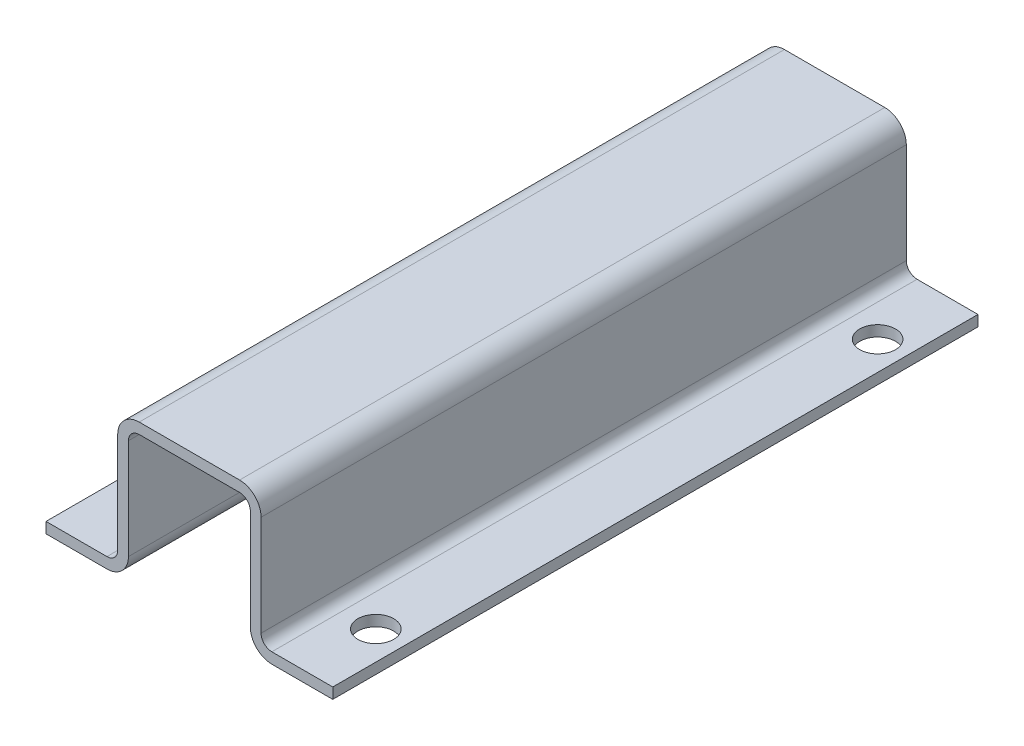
ISO-10303-21;
HEADER;
FILE_DESCRIPTION(('STEP AP214'),'2;1');
FILE_NAME('part.step','',(''),(''),'','','');
FILE_SCHEMA(('AUTOMOTIVE_DESIGN { 1 0 10303 214 1 1 1 1 }'));
ENDSEC;
DATA;
#1=APPLICATION_CONTEXT('core data for automotive mechanical design processes');
#2=APPLICATION_PROTOCOL_DEFINITION('international standard','automotive_design',2000,#1);
#3=PRODUCT_CONTEXT('',#1,'mechanical');
#4=PRODUCT('Part','Part','',(#3));
#5=PRODUCT_RELATED_PRODUCT_CATEGORY('part','',(#4));
#6=PRODUCT_DEFINITION_FORMATION('','',#4);
#7=PRODUCT_DEFINITION_CONTEXT('part definition',#1,'design');
#8=PRODUCT_DEFINITION('design','',#6,#7);
#9=PRODUCT_DEFINITION_SHAPE('','',#8);
#10=(LENGTH_UNIT() NAMED_UNIT(*) SI_UNIT(.MILLI.,.METRE.));
#11=(NAMED_UNIT(*) PLANE_ANGLE_UNIT() SI_UNIT($,.RADIAN.));
#12=(NAMED_UNIT(*) SI_UNIT($,.STERADIAN.) SOLID_ANGLE_UNIT());
#13=UNCERTAINTY_MEASURE_WITH_UNIT(LENGTH_MEASURE(1.E-05),#10,'distance_accuracy_value','');
#14=(GEOMETRIC_REPRESENTATION_CONTEXT(3) GLOBAL_UNCERTAINTY_ASSIGNED_CONTEXT((#13)) GLOBAL_UNIT_ASSIGNED_CONTEXT((#10,
#11,#12)) REPRESENTATION_CONTEXT('',''));
#15=CARTESIAN_POINT('',(0.,0.,0.));
#16=DIRECTION('',(0.,0.,1.));
#17=DIRECTION('',(1.,0.,0.));
#18=AXIS2_PLACEMENT_3D('',#15,#16,#17);
#19=CARTESIAN_POINT('',(11.5,-1.5,45.));
#20=DIRECTION('',(0.,1.,0.));
#21=DIRECTION('',(-1.,0.,0.));
#22=AXIS2_PLACEMENT_3D('',#19,#20,#21);
#23=PLANE('',#22);
#24=CARTESIAN_POINT('',(16.,-1.50000000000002,-35.));
#25=DIRECTION('',(0.,1.,0.));
#26=DIRECTION('',(-1.,0.,0.));
#27=AXIS2_PLACEMENT_3D('',#24,#25,#26);
#28=CIRCLE('',#27,2.5);
#29=CARTESIAN_POINT('',(13.5,-1.50000000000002,-35.));
#30=VERTEX_POINT('',#29);
#31=EDGE_CURVE('E366',#30,#30,#28,.T.);
#32=ORIENTED_EDGE('',*,*,#31,.T.);
#33=EDGE_LOOP('',(#32));
#34=FACE_BOUND('',#33,.T.);
#35=CARTESIAN_POINT('',(16.,-1.50000000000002,35.));
#36=DIRECTION('',(0.,1.,0.));
#37=DIRECTION('',(-1.,0.,0.));
#38=AXIS2_PLACEMENT_3D('',#35,#36,#37);
#39=CIRCLE('',#38,2.5);
#40=CARTESIAN_POINT('',(13.5,-1.50000000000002,35.));
#41=VERTEX_POINT('',#40);
#42=EDGE_CURVE('E184',#41,#41,#39,.T.);
#43=ORIENTED_EDGE('',*,*,#42,.T.);
#44=EDGE_LOOP('',(#43));
#45=FACE_BOUND('',#44,.T.);
#46=DIRECTION('',(1.,0.,0.));
#47=VECTOR('',#46,1.);
#48=CARTESIAN_POINT('',(11.5,-1.5,-45.));
#49=LINE('',#48,#47);
#50=CARTESIAN_POINT('',(11.5,-1.5,-45.));
#51=VERTEX_POINT('',#50);
#52=CARTESIAN_POINT('',(20.,-1.5,-45.));
#53=VERTEX_POINT('',#52);
#54=EDGE_CURVE('E180',#51,#53,#49,.T.);
#55=ORIENTED_EDGE('',*,*,#54,.T.);
#56=DIRECTION('',(0.,0.,-1.));
#57=VECTOR('',#56,1.);
#58=CARTESIAN_POINT('',(20.,-1.5,45.));
#59=LINE('',#58,#57);
#60=CARTESIAN_POINT('',(20.,-1.5,45.));
#61=VERTEX_POINT('',#60);
#62=EDGE_CURVE('E11',#61,#53,#59,.T.);
#63=ORIENTED_EDGE('',*,*,#62,.F.);
#64=DIRECTION('',(1.,0.,0.));
#65=VECTOR('',#64,1.);
#66=CARTESIAN_POINT('',(11.5,-1.5,45.));
#67=LINE('',#66,#65);
#68=CARTESIAN_POINT('',(11.5,-1.5,45.));
#69=VERTEX_POINT('',#68);
#70=EDGE_CURVE('E236',#69,#61,#67,.T.);
#71=ORIENTED_EDGE('',*,*,#70,.F.);
#72=DIRECTION('',(0.,0.,-1.));
#73=VECTOR('',#72,1.);
#74=CARTESIAN_POINT('',(11.5,-1.5,45.));
#75=LINE('',#74,#73);
#76=EDGE_CURVE('E181',#69,#51,#75,.T.);
#77=ORIENTED_EDGE('',*,*,#76,.T.);
#78=EDGE_LOOP('',(#55,#63,#71,#77));
#79=FACE_BOUND('',#78,.T.);
#80=ADVANCED_FACE('F32',(#34,#45,#79),#23,.F.);
#81=CARTESIAN_POINT('',(20.,0.,45.));
#82=DIRECTION('',(1.,0.,0.));
#83=DIRECTION('',(0.,0.,-1.));
#84=AXIS2_PLACEMENT_3D('',#81,#82,#83);
#85=PLANE('',#84);
#86=DIRECTION('',(0.,-1.,0.));
#87=VECTOR('',#86,1.);
#88=CARTESIAN_POINT('',(20.,0.,-45.));
#89=LINE('',#88,#87);
#90=CARTESIAN_POINT('',(20.,0.,-45.));
#91=VERTEX_POINT('',#90);
#92=EDGE_CURVE('E172',#91,#53,#89,.T.);
#93=ORIENTED_EDGE('',*,*,#92,.F.);
#94=DIRECTION('',(0.,0.,-1.));
#95=VECTOR('',#94,1.);
#96=CARTESIAN_POINT('',(20.,0.,45.));
#97=LINE('',#96,#95);
#98=CARTESIAN_POINT('',(20.,0.,45.));
#99=VERTEX_POINT('',#98);
#100=EDGE_CURVE('E40',#99,#91,#97,.T.);
#101=ORIENTED_EDGE('',*,*,#100,.F.);
#102=DIRECTION('',(0.,-1.,0.));
#103=VECTOR('',#102,1.);
#104=CARTESIAN_POINT('',(20.,0.,45.));
#105=LINE('',#104,#103);
#106=EDGE_CURVE('E175',#99,#61,#105,.T.);
#107=ORIENTED_EDGE('',*,*,#106,.T.);
#108=ORIENTED_EDGE('',*,*,#62,.T.);
#109=EDGE_LOOP('',(#93,#101,#107,#108));
#110=FACE_BOUND('',#109,.T.);
#111=ADVANCED_FACE('F170',(#110),#85,.T.);
#112=CARTESIAN_POINT('',(11.5,0.,45.));
#113=DIRECTION('',(0.,1.,0.));
#114=DIRECTION('',(-1.,0.,0.));
#115=AXIS2_PLACEMENT_3D('',#112,#113,#114);
#116=PLANE('',#115);
#117=CARTESIAN_POINT('',(16.,0.,-35.));
#118=DIRECTION('',(0.,1.,0.));
#119=DIRECTION('',(-1.,0.,0.));
#120=AXIS2_PLACEMENT_3D('',#117,#118,#119);
#121=CIRCLE('',#120,2.5);
#122=CARTESIAN_POINT('',(13.5,0.,-35.));
#123=VERTEX_POINT('',#122);
#124=EDGE_CURVE('E368',#123,#123,#121,.T.);
#125=ORIENTED_EDGE('',*,*,#124,.F.);
#126=EDGE_LOOP('',(#125));
#127=FACE_BOUND('',#126,.T.);
#128=CARTESIAN_POINT('',(16.,0.,35.));
#129=DIRECTION('',(0.,1.,0.));
#130=DIRECTION('',(-1.,0.,0.));
#131=AXIS2_PLACEMENT_3D('',#128,#129,#130);
#132=CIRCLE('',#131,2.5);
#133=CARTESIAN_POINT('',(13.5,0.,35.));
#134=VERTEX_POINT('',#133);
#135=EDGE_CURVE('E327',#134,#134,#132,.T.);
#136=ORIENTED_EDGE('',*,*,#135,.F.);
#137=EDGE_LOOP('',(#136));
#138=FACE_BOUND('',#137,.T.);
#139=DIRECTION('',(1.,0.,0.));
#140=VECTOR('',#139,1.);
#141=CARTESIAN_POINT('',(11.5,0.,-45.));
#142=LINE('',#141,#140);
#143=CARTESIAN_POINT('',(11.5,0.,-45.));
#144=VERTEX_POINT('',#143);
#145=EDGE_CURVE('E189',#144,#91,#142,.T.);
#146=ORIENTED_EDGE('',*,*,#145,.F.);
#147=DIRECTION('',(0.,0.,-1.));
#148=VECTOR('',#147,1.);
#149=CARTESIAN_POINT('',(11.5,0.,45.));
#150=LINE('',#149,#148);
#151=CARTESIAN_POINT('',(11.5,0.,45.));
#152=VERTEX_POINT('',#151);
#153=EDGE_CURVE('E323',#152,#144,#150,.T.);
#154=ORIENTED_EDGE('',*,*,#153,.F.);
#155=DIRECTION('',(1.,0.,0.));
#156=VECTOR('',#155,1.);
#157=CARTESIAN_POINT('',(11.5,0.,45.));
#158=LINE('',#157,#156);
#159=EDGE_CURVE('E239',#152,#99,#158,.T.);
#160=ORIENTED_EDGE('',*,*,#159,.T.);
#161=ORIENTED_EDGE('',*,*,#100,.T.);
#162=EDGE_LOOP('',(#146,#154,#160,#161));
#163=FACE_BOUND('',#162,.T.);
#164=ADVANCED_FACE('F363',(#127,#138,#163),#116,.T.);
#165=CARTESIAN_POINT('',(11.5,1.5,45.));
#166=DIRECTION('',(0.,0.,-1.));
#167=DIRECTION('',(-1.,0.,0.));
#168=AXIS2_PLACEMENT_3D('',#165,#166,#167);
#169=CYLINDRICAL_SURFACE('',#168,1.5);
#170=CARTESIAN_POINT('',(11.5,1.5,-45.));
#171=DIRECTION('',(0.,0.,1.));
#172=DIRECTION('',(1.,0.,0.));
#173=AXIS2_PLACEMENT_3D('',#170,#171,#172);
#174=CIRCLE('',#173,1.5);
#175=CARTESIAN_POINT('',(10.,1.5,-45.));
#176=VERTEX_POINT('',#175);
#177=EDGE_CURVE('E191',#176,#144,#174,.T.);
#178=ORIENTED_EDGE('',*,*,#177,.F.);
#179=DIRECTION('',(0.,0.,-1.));
#180=VECTOR('',#179,1.);
#181=CARTESIAN_POINT('',(10.,1.5,45.));
#182=LINE('',#181,#180);
#183=CARTESIAN_POINT('',(10.,1.5,45.));
#184=VERTEX_POINT('',#183);
#185=EDGE_CURVE('E321',#184,#176,#182,.T.);
#186=ORIENTED_EDGE('',*,*,#185,.F.);
#187=CARTESIAN_POINT('',(11.5,1.5,45.));
#188=DIRECTION('',(0.,0.,1.));
#189=DIRECTION('',(1.,0.,0.));
#190=AXIS2_PLACEMENT_3D('',#187,#188,#189);
#191=CIRCLE('',#190,1.5);
#192=EDGE_CURVE('E242',#184,#152,#191,.T.);
#193=ORIENTED_EDGE('',*,*,#192,.T.);
#194=ORIENTED_EDGE('',*,*,#153,.T.);
#195=EDGE_LOOP('',(#178,#186,#193,#194));
#196=FACE_BOUND('',#195,.T.);
#197=ADVANCED_FACE('F378',(#196),#169,.F.);
#198=CARTESIAN_POINT('',(10.,15.5,45.));
#199=DIRECTION('',(1.,0.,0.));
#200=DIRECTION('',(0.,1.,0.));
#201=AXIS2_PLACEMENT_3D('',#198,#199,#200);
#202=PLANE('',#201);
#203=DIRECTION('',(0.,-1.,0.));
#204=VECTOR('',#203,1.);
#205=CARTESIAN_POINT('',(10.,15.5,-45.));
#206=LINE('',#205,#204);
#207=CARTESIAN_POINT('',(10.,15.5,-45.));
#208=VERTEX_POINT('',#207);
#209=EDGE_CURVE('E196',#208,#176,#206,.T.);
#210=ORIENTED_EDGE('',*,*,#209,.F.);
#211=DIRECTION('',(0.,0.,-1.));
#212=VECTOR('',#211,1.);
#213=CARTESIAN_POINT('',(10.,15.5,45.));
#214=LINE('',#213,#212);
#215=CARTESIAN_POINT('',(10.,15.5,45.));
#216=VERTEX_POINT('',#215);
#217=EDGE_CURVE('E319',#216,#208,#214,.T.);
#218=ORIENTED_EDGE('',*,*,#217,.F.);
#219=DIRECTION('',(0.,-1.,0.));
#220=VECTOR('',#219,1.);
#221=CARTESIAN_POINT('',(10.,15.5,45.));
#222=LINE('',#221,#220);
#223=EDGE_CURVE('E245',#216,#184,#222,.T.);
#224=ORIENTED_EDGE('',*,*,#223,.T.);
#225=ORIENTED_EDGE('',*,*,#185,.T.);
#226=EDGE_LOOP('',(#210,#218,#224,#225));
#227=FACE_BOUND('',#226,.T.);
#228=ADVANCED_FACE('F390',(#227),#202,.T.);
#229=CARTESIAN_POINT('',(7.,15.5,45.));
#230=DIRECTION('',(0.,0.,-1.));
#231=DIRECTION('',(-1.,0.,0.));
#232=AXIS2_PLACEMENT_3D('',#229,#230,#231);
#233=CYLINDRICAL_SURFACE('',#232,3.);
#234=CARTESIAN_POINT('',(7.,15.5,-45.));
#235=DIRECTION('',(0.,0.,-1.));
#236=DIRECTION('',(1.,0.,0.));
#237=AXIS2_PLACEMENT_3D('',#234,#235,#236);
#238=CIRCLE('',#237,3.);
#239=CARTESIAN_POINT('',(7.,18.5,-45.));
#240=VERTEX_POINT('',#239);
#241=EDGE_CURVE('E199',#240,#208,#238,.T.);
#242=ORIENTED_EDGE('',*,*,#241,.F.);
#243=DIRECTION('',(0.,0.,-1.));
#244=VECTOR('',#243,1.);
#245=CARTESIAN_POINT('',(7.,18.5,45.));
#246=LINE('',#245,#244);
#247=CARTESIAN_POINT('',(7.,18.5,45.));
#248=VERTEX_POINT('',#247);
#249=EDGE_CURVE('E317',#248,#240,#246,.T.);
#250=ORIENTED_EDGE('',*,*,#249,.F.);
#251=CARTESIAN_POINT('',(7.,15.5,45.));
#252=DIRECTION('',(0.,0.,-1.));
#253=DIRECTION('',(1.,0.,0.));
#254=AXIS2_PLACEMENT_3D('',#251,#252,#253);
#255=CIRCLE('',#254,3.);
#256=EDGE_CURVE('E248',#248,#216,#255,.T.);
#257=ORIENTED_EDGE('',*,*,#256,.T.);
#258=ORIENTED_EDGE('',*,*,#217,.T.);
#259=EDGE_LOOP('',(#242,#250,#257,#258));
#260=FACE_BOUND('',#259,.T.);
#261=ADVANCED_FACE('F393',(#260),#233,.T.);
#262=CARTESIAN_POINT('',(-7.,18.5,45.));
#263=DIRECTION('',(0.,1.,0.));
#264=DIRECTION('',(0.,0.,1.));
#265=AXIS2_PLACEMENT_3D('',#262,#263,#264);
#266=PLANE('',#265);
#267=DIRECTION('',(1.,0.,0.));
#268=VECTOR('',#267,1.);
#269=CARTESIAN_POINT('',(-7.,18.5,-45.));
#270=LINE('',#269,#268);
#271=CARTESIAN_POINT('',(-7.,18.5,-45.));
#272=VERTEX_POINT('',#271);
#273=EDGE_CURVE('E202',#272,#240,#270,.T.);
#274=ORIENTED_EDGE('',*,*,#273,.F.);
#275=DIRECTION('',(0.,0.,-1.));
#276=VECTOR('',#275,1.);
#277=CARTESIAN_POINT('',(-7.,18.5,45.));
#278=LINE('',#277,#276);
#279=CARTESIAN_POINT('',(-7.,18.5,45.));
#280=VERTEX_POINT('',#279);
#281=EDGE_CURVE('E315',#280,#272,#278,.T.);
#282=ORIENTED_EDGE('',*,*,#281,.F.);
#283=DIRECTION('',(1.,0.,0.));
#284=VECTOR('',#283,1.);
#285=CARTESIAN_POINT('',(-7.,18.5,45.));
#286=LINE('',#285,#284);
#287=EDGE_CURVE('E251',#280,#248,#286,.T.);
#288=ORIENTED_EDGE('',*,*,#287,.T.);
#289=ORIENTED_EDGE('',*,*,#249,.T.);
#290=EDGE_LOOP('',(#274,#282,#288,#289));
#291=FACE_BOUND('',#290,.T.);
#292=ADVANCED_FACE('F398',(#291),#266,.T.);
#293=CARTESIAN_POINT('',(-7.,15.5,45.));
#294=DIRECTION('',(0.,0.,-1.));
#295=DIRECTION('',(-1.,0.,0.));
#296=AXIS2_PLACEMENT_3D('',#293,#294,#295);
#297=CYLINDRICAL_SURFACE('',#296,3.);
#298=CARTESIAN_POINT('',(-7.,15.5,-45.));
#299=DIRECTION('',(0.,0.,-1.));
#300=DIRECTION('',(1.,0.,0.));
#301=AXIS2_PLACEMENT_3D('',#298,#299,#300);
#302=CIRCLE('',#301,3.);
#303=CARTESIAN_POINT('',(-10.,15.5,-45.));
#304=VERTEX_POINT('',#303);
#305=EDGE_CURVE('E205',#304,#272,#302,.T.);
#306=ORIENTED_EDGE('',*,*,#305,.F.);
#307=DIRECTION('',(0.,0.,-1.));
#308=VECTOR('',#307,1.);
#309=CARTESIAN_POINT('',(-10.,15.5,45.));
#310=LINE('',#309,#308);
#311=CARTESIAN_POINT('',(-10.,15.5,45.));
#312=VERTEX_POINT('',#311);
#313=EDGE_CURVE('E313',#312,#304,#310,.T.);
#314=ORIENTED_EDGE('',*,*,#313,.F.);
#315=CARTESIAN_POINT('',(-7.,15.5,45.));
#316=DIRECTION('',(0.,0.,-1.));
#317=DIRECTION('',(1.,0.,0.));
#318=AXIS2_PLACEMENT_3D('',#315,#316,#317);
#319=CIRCLE('',#318,3.);
#320=EDGE_CURVE('E254',#312,#280,#319,.T.);
#321=ORIENTED_EDGE('',*,*,#320,.T.);
#322=ORIENTED_EDGE('',*,*,#281,.T.);
#323=EDGE_LOOP('',(#306,#314,#321,#322));
#324=FACE_BOUND('',#323,.T.);
#325=ADVANCED_FACE('F401',(#324),#297,.T.);
#326=CARTESIAN_POINT('',(-10.,1.5,45.));
#327=DIRECTION('',(-1.,0.,0.));
#328=DIRECTION('',(0.,0.,1.));
#329=AXIS2_PLACEMENT_3D('',#326,#327,#328);
#330=PLANE('',#329);
#331=DIRECTION('',(0.,1.,0.));
#332=VECTOR('',#331,1.);
#333=CARTESIAN_POINT('',(-10.,1.5,-45.));
#334=LINE('',#333,#332);
#335=CARTESIAN_POINT('',(-10.,1.5,-45.));
#336=VERTEX_POINT('',#335);
#337=EDGE_CURVE('E208',#336,#304,#334,.T.);
#338=ORIENTED_EDGE('',*,*,#337,.F.);
#339=DIRECTION('',(0.,0.,-1.));
#340=VECTOR('',#339,1.);
#341=CARTESIAN_POINT('',(-10.,1.5,45.));
#342=LINE('',#341,#340);
#343=CARTESIAN_POINT('',(-10.,1.5,45.));
#344=VERTEX_POINT('',#343);
#345=EDGE_CURVE('E311',#344,#336,#342,.T.);
#346=ORIENTED_EDGE('',*,*,#345,.F.);
#347=DIRECTION('',(0.,1.,0.));
#348=VECTOR('',#347,1.);
#349=CARTESIAN_POINT('',(-10.,1.5,45.));
#350=LINE('',#349,#348);
#351=EDGE_CURVE('E257',#344,#312,#350,.T.);
#352=ORIENTED_EDGE('',*,*,#351,.T.);
#353=ORIENTED_EDGE('',*,*,#313,.T.);
#354=EDGE_LOOP('',(#338,#346,#352,#353));
#355=FACE_BOUND('',#354,.T.);
#356=ADVANCED_FACE('F406',(#355),#330,.T.);
#357=CARTESIAN_POINT('',(-11.5,1.5,45.));
#358=DIRECTION('',(0.,0.,-1.));
#359=DIRECTION('',(-1.,0.,0.));
#360=AXIS2_PLACEMENT_3D('',#357,#358,#359);
#361=CYLINDRICAL_SURFACE('',#360,1.5);
#362=CARTESIAN_POINT('',(-11.5,1.5,-45.));
#363=DIRECTION('',(0.,0.,1.));
#364=DIRECTION('',(-1.,0.,0.));
#365=AXIS2_PLACEMENT_3D('',#362,#363,#364);
#366=CIRCLE('',#365,1.5);
#367=CARTESIAN_POINT('',(-11.5,0.,-45.));
#368=VERTEX_POINT('',#367);
#369=EDGE_CURVE('E211',#368,#336,#366,.T.);
#370=ORIENTED_EDGE('',*,*,#369,.F.);
#371=DIRECTION('',(0.,0.,-1.));
#372=VECTOR('',#371,1.);
#373=CARTESIAN_POINT('',(-11.5,0.,45.));
#374=LINE('',#373,#372);
#375=CARTESIAN_POINT('',(-11.5,0.,45.));
#376=VERTEX_POINT('',#375);
#377=EDGE_CURVE('E309',#376,#368,#374,.T.);
#378=ORIENTED_EDGE('',*,*,#377,.F.);
#379=CARTESIAN_POINT('',(-11.5,1.5,45.));
#380=DIRECTION('',(0.,0.,1.));
#381=DIRECTION('',(-1.,0.,0.));
#382=AXIS2_PLACEMENT_3D('',#379,#380,#381);
#383=CIRCLE('',#382,1.5);
#384=EDGE_CURVE('E260',#376,#344,#383,.T.);
#385=ORIENTED_EDGE('',*,*,#384,.T.);
#386=ORIENTED_EDGE('',*,*,#345,.T.);
#387=EDGE_LOOP('',(#370,#378,#385,#386));
#388=FACE_BOUND('',#387,.T.);
#389=ADVANCED_FACE('F409',(#388),#361,.F.);
#390=CARTESIAN_POINT('',(-20.,0.,45.));
#391=DIRECTION('',(0.,1.,0.));
#392=DIRECTION('',(0.,0.,1.));
#393=AXIS2_PLACEMENT_3D('',#390,#391,#392);
#394=PLANE('',#393);
#395=CARTESIAN_POINT('',(-16.,0.,-35.));
#396=DIRECTION('',(0.,1.,0.));
#397=DIRECTION('',(-1.,0.,0.));
#398=AXIS2_PLACEMENT_3D('',#395,#396,#397);
#399=CIRCLE('',#398,2.5);
#400=CARTESIAN_POINT('',(-18.5,0.,-35.));
#401=VERTEX_POINT('',#400);
#402=EDGE_CURVE('E338',#401,#401,#399,.T.);
#403=ORIENTED_EDGE('',*,*,#402,.F.);
#404=EDGE_LOOP('',(#403));
#405=FACE_BOUND('',#404,.T.);
#406=CARTESIAN_POINT('',(-16.,0.,35.));
#407=DIRECTION('',(0.,1.,0.));
#408=DIRECTION('',(-1.,0.,0.));
#409=AXIS2_PLACEMENT_3D('',#406,#407,#408);
#410=CIRCLE('',#409,2.5);
#411=CARTESIAN_POINT('',(-18.5,0.,35.));
#412=VERTEX_POINT('',#411);
#413=EDGE_CURVE('E328',#412,#412,#410,.T.);
#414=ORIENTED_EDGE('',*,*,#413,.F.);
#415=EDGE_LOOP('',(#414));
#416=FACE_BOUND('',#415,.T.);
#417=DIRECTION('',(1.,0.,0.));
#418=VECTOR('',#417,1.);
#419=CARTESIAN_POINT('',(-20.,0.,-45.));
#420=LINE('',#419,#418);
#421=CARTESIAN_POINT('',(-20.,0.,-45.));
#422=VERTEX_POINT('',#421);
#423=EDGE_CURVE('E214',#422,#368,#420,.T.);
#424=ORIENTED_EDGE('',*,*,#423,.F.);
#425=DIRECTION('',(0.,0.,-1.));
#426=VECTOR('',#425,1.);
#427=CARTESIAN_POINT('',(-20.,0.,45.));
#428=LINE('',#427,#426);
#429=CARTESIAN_POINT('',(-20.,0.,45.));
#430=VERTEX_POINT('',#429);
#431=EDGE_CURVE('E307',#430,#422,#428,.T.);
#432=ORIENTED_EDGE('',*,*,#431,.F.);
#433=DIRECTION('',(1.,0.,0.));
#434=VECTOR('',#433,1.);
#435=CARTESIAN_POINT('',(-20.,0.,45.));
#436=LINE('',#435,#434);
#437=EDGE_CURVE('E263',#430,#376,#436,.T.);
#438=ORIENTED_EDGE('',*,*,#437,.T.);
#439=ORIENTED_EDGE('',*,*,#377,.T.);
#440=EDGE_LOOP('',(#424,#432,#438,#439));
#441=FACE_BOUND('',#440,.T.);
#442=ADVANCED_FACE('F414',(#405,#416,#441),#394,.T.);
#443=CARTESIAN_POINT('',(-20.,-1.5,45.));
#444=DIRECTION('',(-1.,0.,0.));
#445=DIRECTION('',(0.,0.,1.));
#446=AXIS2_PLACEMENT_3D('',#443,#444,#445);
#447=PLANE('',#446);
#448=DIRECTION('',(0.,1.,0.));
#449=VECTOR('',#448,1.);
#450=CARTESIAN_POINT('',(-20.,-1.5,-45.));
#451=LINE('',#450,#449);
#452=CARTESIAN_POINT('',(-20.,-1.5,-45.));
#453=VERTEX_POINT('',#452);
#454=EDGE_CURVE('E217',#453,#422,#451,.T.);
#455=ORIENTED_EDGE('',*,*,#454,.F.);
#456=DIRECTION('',(0.,0.,-1.));
#457=VECTOR('',#456,1.);
#458=CARTESIAN_POINT('',(-20.,-1.5,45.));
#459=LINE('',#458,#457);
#460=CARTESIAN_POINT('',(-20.,-1.5,45.));
#461=VERTEX_POINT('',#460);
#462=EDGE_CURVE('E305',#461,#453,#459,.T.);
#463=ORIENTED_EDGE('',*,*,#462,.F.);
#464=DIRECTION('',(0.,1.,0.));
#465=VECTOR('',#464,1.);
#466=CARTESIAN_POINT('',(-20.,-1.5,45.));
#467=LINE('',#466,#465);
#468=EDGE_CURVE('E266',#461,#430,#467,.T.);
#469=ORIENTED_EDGE('',*,*,#468,.T.);
#470=ORIENTED_EDGE('',*,*,#431,.T.);
#471=EDGE_LOOP('',(#455,#463,#469,#470));
#472=FACE_BOUND('',#471,.T.);
#473=ADVANCED_FACE('F417',(#472),#447,.T.);
#474=CARTESIAN_POINT('',(-20.,-1.5,45.));
#475=DIRECTION('',(0.,1.,0.));
#476=DIRECTION('',(0.,0.,1.));
#477=AXIS2_PLACEMENT_3D('',#474,#475,#476);
#478=PLANE('',#477);
#479=CARTESIAN_POINT('',(-16.,-1.50000000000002,-35.));
#480=DIRECTION('',(0.,1.,0.));
#481=DIRECTION('',(0.,0.,1.));
#482=AXIS2_PLACEMENT_3D('',#479,#480,#481);
#483=CIRCLE('',#482,2.5);
#484=CARTESIAN_POINT('',(-18.5,-1.50000000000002,-35.));
#485=VERTEX_POINT('',#484);
#486=EDGE_CURVE('E35',#485,#485,#483,.T.);
#487=ORIENTED_EDGE('',*,*,#486,.T.);
#488=EDGE_LOOP('',(#487));
#489=FACE_BOUND('',#488,.T.);
#490=CARTESIAN_POINT('',(-16.,-1.50000000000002,35.));
#491=DIRECTION('',(0.,1.,0.));
#492=DIRECTION('',(0.,0.,1.));
#493=AXIS2_PLACEMENT_3D('',#490,#491,#492);
#494=CIRCLE('',#493,2.5);
#495=CARTESIAN_POINT('',(-18.5,-1.50000000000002,35.));
#496=VERTEX_POINT('',#495);
#497=EDGE_CURVE('E325',#496,#496,#494,.T.);
#498=ORIENTED_EDGE('',*,*,#497,.T.);
#499=EDGE_LOOP('',(#498));
#500=FACE_BOUND('',#499,.T.);
#501=DIRECTION('',(1.,0.,0.));
#502=VECTOR('',#501,1.);
#503=CARTESIAN_POINT('',(-20.,-1.5,-45.));
#504=LINE('',#503,#502);
#505=CARTESIAN_POINT('',(-11.5,-1.5,-45.));
#506=VERTEX_POINT('',#505);
#507=EDGE_CURVE('E220',#453,#506,#504,.T.);
#508=ORIENTED_EDGE('',*,*,#507,.T.);
#509=DIRECTION('',(0.,0.,-1.));
#510=VECTOR('',#509,1.);
#511=CARTESIAN_POINT('',(-11.5,-1.5,45.));
#512=LINE('',#511,#510);
#513=CARTESIAN_POINT('',(-11.5,-1.5,45.));
#514=VERTEX_POINT('',#513);
#515=EDGE_CURVE('E302',#514,#506,#512,.T.);
#516=ORIENTED_EDGE('',*,*,#515,.F.);
#517=DIRECTION('',(1.,0.,0.));
#518=VECTOR('',#517,1.);
#519=CARTESIAN_POINT('',(-20.,-1.5,45.));
#520=LINE('',#519,#518);
#521=EDGE_CURVE('E269',#461,#514,#520,.T.);
#522=ORIENTED_EDGE('',*,*,#521,.F.);
#523=ORIENTED_EDGE('',*,*,#462,.T.);
#524=EDGE_LOOP('',(#508,#516,#522,#523));
#525=FACE_BOUND('',#524,.T.);
#526=ADVANCED_FACE('F423',(#489,#500,#525),#478,.F.);
#527=CARTESIAN_POINT('',(-11.5,1.5,45.));
#528=DIRECTION('',(0.,0.,-1.));
#529=DIRECTION('',(-1.,0.,0.));
#530=AXIS2_PLACEMENT_3D('',#527,#528,#529);
#531=CYLINDRICAL_SURFACE('',#530,3.);
#532=CARTESIAN_POINT('',(-11.5,1.5,-45.));
#533=DIRECTION('',(0.,0.,1.));
#534=DIRECTION('',(1.,0.,0.));
#535=AXIS2_PLACEMENT_3D('',#532,#533,#534);
#536=CIRCLE('',#535,3.);
#537=CARTESIAN_POINT('',(-8.5,1.5,-45.));
#538=VERTEX_POINT('',#537);
#539=EDGE_CURVE('E222',#506,#538,#536,.T.);
#540=ORIENTED_EDGE('',*,*,#539,.T.);
#541=DIRECTION('',(0.,0.,-1.));
#542=VECTOR('',#541,1.);
#543=CARTESIAN_POINT('',(-8.5,1.5,45.));
#544=LINE('',#543,#542);
#545=CARTESIAN_POINT('',(-8.5,1.5,45.));
#546=VERTEX_POINT('',#545);
#547=EDGE_CURVE('E299',#546,#538,#544,.T.);
#548=ORIENTED_EDGE('',*,*,#547,.F.);
#549=CARTESIAN_POINT('',(-11.5,1.5,45.));
#550=DIRECTION('',(0.,0.,1.));
#551=DIRECTION('',(1.,0.,0.));
#552=AXIS2_PLACEMENT_3D('',#549,#550,#551);
#553=CIRCLE('',#552,3.);
#554=EDGE_CURVE('E271',#514,#546,#553,.T.);
#555=ORIENTED_EDGE('',*,*,#554,.F.);
#556=ORIENTED_EDGE('',*,*,#515,.T.);
#557=EDGE_LOOP('',(#540,#548,#555,#556));
#558=FACE_BOUND('',#557,.T.);
#559=ADVANCED_FACE('F427',(#558),#531,.T.);
#560=CARTESIAN_POINT('',(-8.5,1.5,45.));
#561=DIRECTION('',(-1.,0.,0.));
#562=DIRECTION('',(0.,0.,1.));
#563=AXIS2_PLACEMENT_3D('',#560,#561,#562);
#564=PLANE('',#563);
#565=DIRECTION('',(0.,1.,0.));
#566=VECTOR('',#565,1.);
#567=CARTESIAN_POINT('',(-8.5,1.5,-45.));
#568=LINE('',#567,#566);
#569=CARTESIAN_POINT('',(-8.5,15.5,-45.));
#570=VERTEX_POINT('',#569);
#571=EDGE_CURVE('E224',#538,#570,#568,.T.);
#572=ORIENTED_EDGE('',*,*,#571,.T.);
#573=DIRECTION('',(0.,0.,-1.));
#574=VECTOR('',#573,1.);
#575=CARTESIAN_POINT('',(-8.5,15.5,45.));
#576=LINE('',#575,#574);
#577=CARTESIAN_POINT('',(-8.5,15.5,45.));
#578=VERTEX_POINT('',#577);
#579=EDGE_CURVE('E296',#578,#570,#576,.T.);
#580=ORIENTED_EDGE('',*,*,#579,.F.);
#581=DIRECTION('',(0.,1.,0.));
#582=VECTOR('',#581,1.);
#583=CARTESIAN_POINT('',(-8.5,1.5,45.));
#584=LINE('',#583,#582);
#585=EDGE_CURVE('E273',#546,#578,#584,.T.);
#586=ORIENTED_EDGE('',*,*,#585,.F.);
#587=ORIENTED_EDGE('',*,*,#547,.T.);
#588=EDGE_LOOP('',(#572,#580,#586,#587));
#589=FACE_BOUND('',#588,.T.);
#590=ADVANCED_FACE('F432',(#589),#564,.F.);
#591=CARTESIAN_POINT('',(-7.,15.5,45.));
#592=DIRECTION('',(0.,0.,-1.));
#593=DIRECTION('',(-1.,0.,0.));
#594=AXIS2_PLACEMENT_3D('',#591,#592,#593);
#595=CYLINDRICAL_SURFACE('',#594,1.5);
#596=CARTESIAN_POINT('',(-7.,15.5,-45.));
#597=DIRECTION('',(0.,0.,1.));
#598=DIRECTION('',(1.,0.,0.));
#599=AXIS2_PLACEMENT_3D('',#596,#597,#598);
#600=CIRCLE('',#599,1.5);
#601=CARTESIAN_POINT('',(-7.,17.,-45.));
#602=VERTEX_POINT('',#601);
#603=EDGE_CURVE('E226',#570,#602,#600,.F.);
#604=ORIENTED_EDGE('',*,*,#603,.T.);
#605=DIRECTION('',(0.,0.,-1.));
#606=VECTOR('',#605,1.);
#607=CARTESIAN_POINT('',(-7.,17.,45.));
#608=LINE('',#607,#606);
#609=CARTESIAN_POINT('',(-7.,17.,45.));
#610=VERTEX_POINT('',#609);
#611=EDGE_CURVE('E293',#610,#602,#608,.T.);
#612=ORIENTED_EDGE('',*,*,#611,.F.);
#613=CARTESIAN_POINT('',(-7.,15.5,45.));
#614=DIRECTION('',(0.,0.,1.));
#615=DIRECTION('',(1.,0.,0.));
#616=AXIS2_PLACEMENT_3D('',#613,#614,#615);
#617=CIRCLE('',#616,1.5);
#618=EDGE_CURVE('E275',#578,#610,#617,.F.);
#619=ORIENTED_EDGE('',*,*,#618,.F.);
#620=ORIENTED_EDGE('',*,*,#579,.T.);
#621=EDGE_LOOP('',(#604,#612,#619,#620));
#622=FACE_BOUND('',#621,.T.);
#623=ADVANCED_FACE('F438',(#622),#595,.F.);
#624=CARTESIAN_POINT('',(-7.,17.,45.));
#625=DIRECTION('',(0.,1.,0.));
#626=DIRECTION('',(0.,0.,1.));
#627=AXIS2_PLACEMENT_3D('',#624,#625,#626);
#628=PLANE('',#627);
#629=DIRECTION('',(1.,0.,0.));
#630=VECTOR('',#629,1.);
#631=CARTESIAN_POINT('',(-7.,17.,-45.));
#632=LINE('',#631,#630);
#633=CARTESIAN_POINT('',(7.,17.,-45.));
#634=VERTEX_POINT('',#633);
#635=EDGE_CURVE('E228',#602,#634,#632,.T.);
#636=ORIENTED_EDGE('',*,*,#635,.T.);
#637=DIRECTION('',(0.,0.,-1.));
#638=VECTOR('',#637,1.);
#639=CARTESIAN_POINT('',(7.,17.,45.));
#640=LINE('',#639,#638);
#641=CARTESIAN_POINT('',(7.,17.,45.));
#642=VERTEX_POINT('',#641);
#643=EDGE_CURVE('E290',#642,#634,#640,.T.);
#644=ORIENTED_EDGE('',*,*,#643,.F.);
#645=DIRECTION('',(1.,0.,0.));
#646=VECTOR('',#645,1.);
#647=CARTESIAN_POINT('',(-7.,17.,45.));
#648=LINE('',#647,#646);
#649=EDGE_CURVE('E277',#610,#642,#648,.T.);
#650=ORIENTED_EDGE('',*,*,#649,.F.);
#651=ORIENTED_EDGE('',*,*,#611,.T.);
#652=EDGE_LOOP('',(#636,#644,#650,#651));
#653=FACE_BOUND('',#652,.T.);
#654=ADVANCED_FACE('F442',(#653),#628,.F.);
#655=CARTESIAN_POINT('',(7.,15.5,45.));
#656=DIRECTION('',(0.,0.,-1.));
#657=DIRECTION('',(-1.,0.,0.));
#658=AXIS2_PLACEMENT_3D('',#655,#656,#657);
#659=CYLINDRICAL_SURFACE('',#658,1.5);
#660=CARTESIAN_POINT('',(7.,15.5,-45.));
#661=DIRECTION('',(0.,0.,1.));
#662=DIRECTION('',(1.,0.,0.));
#663=AXIS2_PLACEMENT_3D('',#660,#661,#662);
#664=CIRCLE('',#663,1.5);
#665=CARTESIAN_POINT('',(8.5,15.5,-45.));
#666=VERTEX_POINT('',#665);
#667=EDGE_CURVE('E230',#634,#666,#664,.F.);
#668=ORIENTED_EDGE('',*,*,#667,.T.);
#669=DIRECTION('',(0.,0.,-1.));
#670=VECTOR('',#669,1.);
#671=CARTESIAN_POINT('',(8.5,15.5,45.));
#672=LINE('',#671,#670);
#673=CARTESIAN_POINT('',(8.5,15.5,45.));
#674=VERTEX_POINT('',#673);
#675=EDGE_CURVE('E287',#674,#666,#672,.T.);
#676=ORIENTED_EDGE('',*,*,#675,.F.);
#677=CARTESIAN_POINT('',(7.,15.5,45.));
#678=DIRECTION('',(0.,0.,1.));
#679=DIRECTION('',(1.,0.,0.));
#680=AXIS2_PLACEMENT_3D('',#677,#678,#679);
#681=CIRCLE('',#680,1.5);
#682=EDGE_CURVE('E279',#642,#674,#681,.F.);
#683=ORIENTED_EDGE('',*,*,#682,.F.);
#684=ORIENTED_EDGE('',*,*,#643,.T.);
#685=EDGE_LOOP('',(#668,#676,#683,#684));
#686=FACE_BOUND('',#685,.T.);
#687=ADVANCED_FACE('F447',(#686),#659,.F.);
#688=CARTESIAN_POINT('',(8.5,15.5,45.));
#689=DIRECTION('',(1.,0.,0.));
#690=DIRECTION('',(0.,1.,0.));
#691=AXIS2_PLACEMENT_3D('',#688,#689,#690);
#692=PLANE('',#691);
#693=DIRECTION('',(0.,-1.,0.));
#694=VECTOR('',#693,1.);
#695=CARTESIAN_POINT('',(8.5,15.5,-45.));
#696=LINE('',#695,#694);
#697=CARTESIAN_POINT('',(8.5,1.5,-45.));
#698=VERTEX_POINT('',#697);
#699=EDGE_CURVE('E232',#666,#698,#696,.T.);
#700=ORIENTED_EDGE('',*,*,#699,.T.);
#701=DIRECTION('',(0.,0.,-1.));
#702=VECTOR('',#701,1.);
#703=CARTESIAN_POINT('',(8.5,1.5,45.));
#704=LINE('',#703,#702);
#705=CARTESIAN_POINT('',(8.5,1.5,45.));
#706=VERTEX_POINT('',#705);
#707=EDGE_CURVE('E284',#706,#698,#704,.T.);
#708=ORIENTED_EDGE('',*,*,#707,.F.);
#709=DIRECTION('',(0.,-1.,0.));
#710=VECTOR('',#709,1.);
#711=CARTESIAN_POINT('',(8.5,15.5,45.));
#712=LINE('',#711,#710);
#713=EDGE_CURVE('E53',#674,#706,#712,.T.);
#714=ORIENTED_EDGE('',*,*,#713,.F.);
#715=ORIENTED_EDGE('',*,*,#675,.T.);
#716=EDGE_LOOP('',(#700,#708,#714,#715));
#717=FACE_BOUND('',#716,.T.);
#718=ADVANCED_FACE('F450',(#717),#692,.F.);
#719=CARTESIAN_POINT('',(11.5,1.5,45.));
#720=DIRECTION('',(0.,0.,-1.));
#721=DIRECTION('',(-1.,0.,0.));
#722=AXIS2_PLACEMENT_3D('',#719,#720,#721);
#723=CYLINDRICAL_SURFACE('',#722,3.);
#724=CARTESIAN_POINT('',(11.5,1.5,-45.));
#725=DIRECTION('',(0.,0.,1.));
#726=DIRECTION('',(1.,0.,0.));
#727=AXIS2_PLACEMENT_3D('',#724,#725,#726);
#728=CIRCLE('',#727,3.);
#729=EDGE_CURVE('E234',#698,#51,#728,.T.);
#730=ORIENTED_EDGE('',*,*,#729,.T.);
#731=ORIENTED_EDGE('',*,*,#76,.F.);
#732=CARTESIAN_POINT('',(11.5,1.5,45.));
#733=DIRECTION('',(0.,0.,1.));
#734=DIRECTION('',(1.,0.,0.));
#735=AXIS2_PLACEMENT_3D('',#732,#733,#734);
#736=CIRCLE('',#735,3.);
#737=EDGE_CURVE('E48',#706,#69,#736,.T.);
#738=ORIENTED_EDGE('',*,*,#737,.F.);
#739=ORIENTED_EDGE('',*,*,#707,.T.);
#740=EDGE_LOOP('',(#730,#731,#738,#739));
#741=FACE_BOUND('',#740,.T.);
#742=ADVANCED_FACE('F452',(#741),#723,.T.);
#743=CARTESIAN_POINT('',(11.5,1.5,45.));
#744=DIRECTION('',(0.,0.,1.));
#745=DIRECTION('',(1.,0.,0.));
#746=AXIS2_PLACEMENT_3D('',#743,#744,#745);
#747=PLANE('',#746);
#748=ORIENTED_EDGE('',*,*,#70,.T.);
#749=ORIENTED_EDGE('',*,*,#106,.F.);
#750=ORIENTED_EDGE('',*,*,#159,.F.);
#751=ORIENTED_EDGE('',*,*,#192,.F.);
#752=ORIENTED_EDGE('',*,*,#223,.F.);
#753=ORIENTED_EDGE('',*,*,#256,.F.);
#754=ORIENTED_EDGE('',*,*,#287,.F.);
#755=ORIENTED_EDGE('',*,*,#320,.F.);
#756=ORIENTED_EDGE('',*,*,#351,.F.);
#757=ORIENTED_EDGE('',*,*,#384,.F.);
#758=ORIENTED_EDGE('',*,*,#437,.F.);
#759=ORIENTED_EDGE('',*,*,#468,.F.);
#760=ORIENTED_EDGE('',*,*,#521,.T.);
#761=ORIENTED_EDGE('',*,*,#554,.T.);
#762=ORIENTED_EDGE('',*,*,#585,.T.);
#763=ORIENTED_EDGE('',*,*,#618,.T.);
#764=ORIENTED_EDGE('',*,*,#649,.T.);
#765=ORIENTED_EDGE('',*,*,#682,.T.);
#766=ORIENTED_EDGE('',*,*,#713,.T.);
#767=ORIENTED_EDGE('',*,*,#737,.T.);
#768=EDGE_LOOP('',(#748,#749,#750,#751,#752,#753,#754,#755,#756,#757,#758,#759,#760,#761,#762,
#763,#764,#765,#766,#767));
#769=FACE_BOUND('',#768,.T.);
#770=ADVANCED_FACE('F356',(#769),#747,.T.);
#771=CARTESIAN_POINT('',(11.5,1.5,-45.));
#772=DIRECTION('',(0.,0.,1.));
#773=DIRECTION('',(1.,0.,0.));
#774=AXIS2_PLACEMENT_3D('',#771,#772,#773);
#775=PLANE('',#774);
#776=ORIENTED_EDGE('',*,*,#54,.F.);
#777=ORIENTED_EDGE('',*,*,#729,.F.);
#778=ORIENTED_EDGE('',*,*,#699,.F.);
#779=ORIENTED_EDGE('',*,*,#667,.F.);
#780=ORIENTED_EDGE('',*,*,#635,.F.);
#781=ORIENTED_EDGE('',*,*,#603,.F.);
#782=ORIENTED_EDGE('',*,*,#571,.F.);
#783=ORIENTED_EDGE('',*,*,#539,.F.);
#784=ORIENTED_EDGE('',*,*,#507,.F.);
#785=ORIENTED_EDGE('',*,*,#454,.T.);
#786=ORIENTED_EDGE('',*,*,#423,.T.);
#787=ORIENTED_EDGE('',*,*,#369,.T.);
#788=ORIENTED_EDGE('',*,*,#337,.T.);
#789=ORIENTED_EDGE('',*,*,#305,.T.);
#790=ORIENTED_EDGE('',*,*,#273,.T.);
#791=ORIENTED_EDGE('',*,*,#241,.T.);
#792=ORIENTED_EDGE('',*,*,#209,.T.);
#793=ORIENTED_EDGE('',*,*,#177,.T.);
#794=ORIENTED_EDGE('',*,*,#145,.T.);
#795=ORIENTED_EDGE('',*,*,#92,.T.);
#796=EDGE_LOOP('',(#776,#777,#778,#779,#780,#781,#782,#783,#784,#785,#786,#787,#788,#789,#790,
#791,#792,#793,#794,#795));
#797=FACE_BOUND('',#796,.T.);
#798=ADVANCED_FACE('F186',(#797),#775,.F.);
#799=CARTESIAN_POINT('',(16.,-90.,35.));
#800=DIRECTION('',(0.,1.,0.));
#801=DIRECTION('',(-1.,0.,0.));
#802=AXIS2_PLACEMENT_3D('',#799,#800,#801);
#803=CYLINDRICAL_SURFACE('',#802,2.5);
#804=CARTESIAN_POINT('',(13.5,0.,35.));
#805=CARTESIAN_POINT('',(13.5,-0.0156249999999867,35.));
#806=CARTESIAN_POINT('',(13.5,-0.0312499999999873,35.));
#807=CARTESIAN_POINT('',(13.5,-0.0624999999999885,35.));
#808=CARTESIAN_POINT('',(13.5,-0.0781249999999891,35.));
#809=CARTESIAN_POINT('',(13.5,-0.10937499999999,35.));
#810=CARTESIAN_POINT('',(13.5,-0.124999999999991,35.));
#811=CARTESIAN_POINT('',(13.5,-0.156249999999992,35.));
#812=CARTESIAN_POINT('',(13.5,-0.171874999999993,35.));
#813=CARTESIAN_POINT('',(13.5,-0.203124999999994,35.));
#814=CARTESIAN_POINT('',(13.5,-0.218749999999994,35.));
#815=CARTESIAN_POINT('',(13.5,-0.249999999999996,35.));
#816=CARTESIAN_POINT('',(13.5,-0.265624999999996,35.));
#817=CARTESIAN_POINT('',(13.5,-0.296874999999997,35.));
#818=CARTESIAN_POINT('',(13.5,-0.312499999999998,35.));
#819=CARTESIAN_POINT('',(13.5,-0.343749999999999,35.));
#820=CARTESIAN_POINT('',(13.5,-0.359375,35.));
#821=CARTESIAN_POINT('',(13.5,-0.390624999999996,35.));
#822=CARTESIAN_POINT('',(13.5,-0.406249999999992,35.));
#823=CARTESIAN_POINT('',(13.5,-0.437499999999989,35.));
#824=CARTESIAN_POINT('',(13.5,-0.453124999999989,35.));
#825=CARTESIAN_POINT('',(13.5,-0.484374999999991,35.));
#826=CARTESIAN_POINT('',(13.5,-0.499999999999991,35.));
#827=CARTESIAN_POINT('',(13.5,-0.531249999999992,35.));
#828=CARTESIAN_POINT('',(13.5,-0.546874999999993,35.));
#829=CARTESIAN_POINT('',(13.5,-0.578124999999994,35.));
#830=CARTESIAN_POINT('',(13.5,-0.593749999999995,35.));
#831=CARTESIAN_POINT('',(13.5,-0.624999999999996,35.));
#832=CARTESIAN_POINT('',(13.5,-0.640624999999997,35.));
#833=CARTESIAN_POINT('',(13.5,-0.671874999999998,35.));
#834=CARTESIAN_POINT('',(13.5,-0.687499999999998,35.));
#835=CARTESIAN_POINT('',(13.5,-0.718749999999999,35.));
#836=CARTESIAN_POINT('',(13.5,-0.734375,35.));
#837=CARTESIAN_POINT('',(13.5,-0.765625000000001,35.));
#838=CARTESIAN_POINT('',(13.5,-0.781250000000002,35.));
#839=CARTESIAN_POINT('',(13.5,-0.812500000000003,35.));
#840=CARTESIAN_POINT('',(13.5,-0.828125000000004,35.));
#841=CARTESIAN_POINT('',(13.5,-0.859375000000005,35.));
#842=CARTESIAN_POINT('',(13.5,-0.875000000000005,35.));
#843=CARTESIAN_POINT('',(13.5,-0.906250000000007,35.));
#844=CARTESIAN_POINT('',(13.5,-0.921875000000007,35.));
#845=CARTESIAN_POINT('',(13.5,-0.953125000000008,35.));
#846=CARTESIAN_POINT('',(13.5,-0.968750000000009,35.));
#847=CARTESIAN_POINT('',(13.5,-1.00000000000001,35.));
#848=CARTESIAN_POINT('',(13.5,-1.01562500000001,35.));
#849=CARTESIAN_POINT('',(13.5,-1.04687500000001,35.));
#850=CARTESIAN_POINT('',(13.5,-1.06250000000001,35.));
#851=CARTESIAN_POINT('',(13.5,-1.09375000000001,35.));
#852=CARTESIAN_POINT('',(13.5,-1.10937500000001,35.));
#853=CARTESIAN_POINT('',(13.5,-1.140625,35.));
#854=CARTESIAN_POINT('',(13.5,-1.15625,35.));
#855=CARTESIAN_POINT('',(13.5,-1.1875,35.));
#856=CARTESIAN_POINT('',(13.5,-1.203125,35.));
#857=CARTESIAN_POINT('',(13.5,-1.23437500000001,35.));
#858=CARTESIAN_POINT('',(13.5,-1.25000000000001,35.));
#859=CARTESIAN_POINT('',(13.5,-1.28125000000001,35.));
#860=CARTESIAN_POINT('',(13.5,-1.29687500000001,35.));
#861=CARTESIAN_POINT('',(13.5,-1.32812500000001,35.));
#862=CARTESIAN_POINT('',(13.5,-1.34375000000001,35.));
#863=CARTESIAN_POINT('',(13.5,-1.37500000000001,35.));
#864=CARTESIAN_POINT('',(13.5,-1.39062500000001,35.));
#865=CARTESIAN_POINT('',(13.5,-1.42187500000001,35.));
#866=CARTESIAN_POINT('',(13.5,-1.43750000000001,35.));
#867=CARTESIAN_POINT('',(13.5,-1.46875000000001,35.));
#868=CARTESIAN_POINT('',(13.5,-1.48437500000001,35.));
#869=CARTESIAN_POINT('',(13.5,-1.50000000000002,35.));
#870=B_SPLINE_CURVE_WITH_KNOTS('',3,(#804,#805,#806,#807,#808,#809,#810,#811,#812,#813,#814,
#815,#816,#817,#818,#819,#820,#821,#822,#823,#824,#825,#826,#827,#828,#829,#830,#831,#832,#833,
#834,#835,#836,#837,#838,#839,#840,#841,#842,#843,#844,#845,#846,#847,#848,#849,#850,#851,#852,
#853,#854,#855,#856,#857,#858,#859,#860,#861,#862,#863,#864,#865,#866,#867,#868,#869),
.UNSPECIFIED.,.F.,.F.,(4,2,2,2,2,2,2,2,2,2,2,2,2,2,2,2,2,2,2,2,2,2,2,2,2,2,2,2,2,2,2,2,4),(0.,
0.0468750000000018,0.0937500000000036,0.140625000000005,0.187500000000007,0.234375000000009,
0.281250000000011,0.328125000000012,0.375000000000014,0.421875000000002,0.468750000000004,
0.515625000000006,0.562500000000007,0.609375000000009,0.656250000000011,0.703125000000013,
0.750000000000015,0.796875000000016,0.843750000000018,0.89062500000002,0.937500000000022,
0.984375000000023,1.03125000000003,1.07812500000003,1.12500000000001,1.17187500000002,
1.21875000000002,1.26562500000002,1.31250000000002,1.35937500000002,1.40625000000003,
1.45312500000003,1.50000000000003),.UNSPECIFIED.);
#871=EDGE_CURVE('BSEAM345',#134,#41,#870,.T.);
#872=ORIENTED_EDGE('',*,*,#135,.T.);
#873=ORIENTED_EDGE('',*,*,#42,.F.);
#874=ORIENTED_EDGE('',*,*,#871,.T.);
#875=ORIENTED_EDGE('',*,*,#871,.F.);
#876=EDGE_LOOP('',(#872,#874,#873,#875));
#877=FACE_BOUND('',#876,.T.);
#878=ADVANCED_FACE('F345',(#877),#803,.F.);
#879=CARTESIAN_POINT('',(-16.,-90.,35.));
#880=DIRECTION('',(0.,1.,0.));
#881=DIRECTION('',(-1.,0.,0.));
#882=AXIS2_PLACEMENT_3D('',#879,#880,#881);
#883=CYLINDRICAL_SURFACE('',#882,2.5);
#884=CARTESIAN_POINT('',(-18.5,0.,35.));
#885=CARTESIAN_POINT('',(-18.5,-0.0156250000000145,35.));
#886=CARTESIAN_POINT('',(-18.5,-0.0312500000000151,35.));
#887=CARTESIAN_POINT('',(-18.5,-0.0625000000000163,35.));
#888=CARTESIAN_POINT('',(-18.5,-0.0781250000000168,35.));
#889=CARTESIAN_POINT('',(-18.5,-0.109375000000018,35.));
#890=CARTESIAN_POINT('',(-18.5,-0.125000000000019,35.));
#891=CARTESIAN_POINT('',(-18.5,-0.15625000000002,35.));
#892=CARTESIAN_POINT('',(-18.5,-0.17187500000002,35.));
#893=CARTESIAN_POINT('',(-18.5,-0.203125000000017,35.));
#894=CARTESIAN_POINT('',(-18.5,-0.218750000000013,35.));
#895=CARTESIAN_POINT('',(-18.5,-0.250000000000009,35.));
#896=CARTESIAN_POINT('',(-18.5,-0.26562500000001,35.));
#897=CARTESIAN_POINT('',(-18.5,-0.296875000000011,35.));
#898=CARTESIAN_POINT('',(-18.5,-0.312500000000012,35.));
#899=CARTESIAN_POINT('',(-18.5,-0.343750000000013,35.));
#900=CARTESIAN_POINT('',(-18.5,-0.359375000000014,35.));
#901=CARTESIAN_POINT('',(-18.5,-0.390625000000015,35.));
#902=CARTESIAN_POINT('',(-18.5,-0.406250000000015,35.));
#903=CARTESIAN_POINT('',(-18.5,-0.437500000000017,35.));
#904=CARTESIAN_POINT('',(-18.5,-0.453125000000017,35.));
#905=CARTESIAN_POINT('',(-18.5,-0.484375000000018,35.));
#906=CARTESIAN_POINT('',(-18.5,-0.500000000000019,35.));
#907=CARTESIAN_POINT('',(-18.5,-0.531250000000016,35.));
#908=CARTESIAN_POINT('',(-18.5,-0.546875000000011,35.));
#909=CARTESIAN_POINT('',(-18.5,-0.578125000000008,35.));
#910=CARTESIAN_POINT('',(-18.5,-0.593750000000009,35.));
#911=CARTESIAN_POINT('',(-18.5,-0.62500000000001,35.));
#912=CARTESIAN_POINT('',(-18.5,-0.64062500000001,35.));
#913=CARTESIAN_POINT('',(-18.5,-0.671875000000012,35.));
#914=CARTESIAN_POINT('',(-18.5,-0.687500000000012,35.));
#915=CARTESIAN_POINT('',(-18.5,-0.718750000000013,35.));
#916=CARTESIAN_POINT('',(-18.5,-0.734375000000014,35.));
#917=CARTESIAN_POINT('',(-18.5,-0.765625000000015,35.));
#918=CARTESIAN_POINT('',(-18.5,-0.781250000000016,35.));
#919=CARTESIAN_POINT('',(-18.5,-0.812500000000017,35.));
#920=CARTESIAN_POINT('',(-18.5,-0.828125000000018,35.));
#921=CARTESIAN_POINT('',(-18.5,-0.859375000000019,35.));
#922=CARTESIAN_POINT('',(-18.5,-0.875000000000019,35.));
#923=CARTESIAN_POINT('',(-18.5,-0.90625000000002,35.));
#924=CARTESIAN_POINT('',(-18.5,-0.921875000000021,35.));
#925=CARTESIAN_POINT('',(-18.5,-0.953125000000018,35.));
#926=CARTESIAN_POINT('',(-18.5,-0.968750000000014,35.));
#927=CARTESIAN_POINT('',(-18.5,-1.00000000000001,35.));
#928=CARTESIAN_POINT('',(-18.5,-1.01562500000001,35.));
#929=CARTESIAN_POINT('',(-18.5,-1.04687500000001,35.));
#930=CARTESIAN_POINT('',(-18.5,-1.06250000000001,35.));
#931=CARTESIAN_POINT('',(-18.5,-1.09375000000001,35.));
#932=CARTESIAN_POINT('',(-18.5,-1.10937500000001,35.));
#933=CARTESIAN_POINT('',(-18.5,-1.14062500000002,35.));
#934=CARTESIAN_POINT('',(-18.5,-1.15625000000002,35.));
#935=CARTESIAN_POINT('',(-18.5,-1.18750000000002,35.));
#936=CARTESIAN_POINT('',(-18.5,-1.20312500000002,35.));
#937=CARTESIAN_POINT('',(-18.5,-1.23437500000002,35.));
#938=CARTESIAN_POINT('',(-18.5,-1.25000000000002,35.));
#939=CARTESIAN_POINT('',(-18.5,-1.28125000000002,35.));
#940=CARTESIAN_POINT('',(-18.5,-1.29687500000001,35.));
#941=CARTESIAN_POINT('',(-18.5,-1.32812500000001,35.));
#942=CARTESIAN_POINT('',(-18.5,-1.34375000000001,35.));
#943=CARTESIAN_POINT('',(-18.5,-1.37500000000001,35.));
#944=CARTESIAN_POINT('',(-18.5,-1.39062500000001,35.));
#945=CARTESIAN_POINT('',(-18.5,-1.42187500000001,35.));
#946=CARTESIAN_POINT('',(-18.5,-1.43750000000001,35.));
#947=CARTESIAN_POINT('',(-18.5,-1.46875000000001,35.));
#948=CARTESIAN_POINT('',(-18.5,-1.48437500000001,35.));
#949=CARTESIAN_POINT('',(-18.5,-1.50000000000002,35.));
#950=B_SPLINE_CURVE_WITH_KNOTS('',3,(#884,#885,#886,#887,#888,#889,#890,#891,#892,#893,#894,
#895,#896,#897,#898,#899,#900,#901,#902,#903,#904,#905,#906,#907,#908,#909,#910,#911,#912,#913,
#914,#915,#916,#917,#918,#919,#920,#921,#922,#923,#924,#925,#926,#927,#928,#929,#930,#931,#932,
#933,#934,#935,#936,#937,#938,#939,#940,#941,#942,#943,#944,#945,#946,#947,#948,#949),
.UNSPECIFIED.,.F.,.F.,(4,2,2,2,2,2,2,2,2,2,2,2,2,2,2,2,2,2,2,2,2,2,2,2,2,2,2,2,2,2,2,2,4),(0.,
0.0468750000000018,0.0937500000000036,0.140625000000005,0.187500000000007,0.234374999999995,
0.281249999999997,0.328124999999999,0.375,0.421875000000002,0.468750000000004,0.515625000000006,
0.562499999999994,0.609374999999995,0.656249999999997,0.703124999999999,0.750000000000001,
0.796875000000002,0.843750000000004,0.890625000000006,0.937500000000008,0.984374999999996,
1.03125,1.078125,1.125,1.171875,1.21875,1.26562500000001,1.31249999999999,1.359375,1.40625,
1.453125,1.5),.UNSPECIFIED.);
#951=EDGE_CURVE('BSEAM347',#412,#496,#950,.T.);
#952=ORIENTED_EDGE('',*,*,#413,.T.);
#953=ORIENTED_EDGE('',*,*,#497,.F.);
#954=ORIENTED_EDGE('',*,*,#951,.T.);
#955=ORIENTED_EDGE('',*,*,#951,.F.);
#956=EDGE_LOOP('',(#952,#954,#953,#955));
#957=FACE_BOUND('',#956,.T.);
#958=ADVANCED_FACE('F347',(#957),#883,.F.);
#959=CARTESIAN_POINT('',(-16.,-90.,-35.));
#960=DIRECTION('',(0.,1.,0.));
#961=DIRECTION('',(-1.,0.,0.));
#962=AXIS2_PLACEMENT_3D('',#959,#960,#961);
#963=CYLINDRICAL_SURFACE('',#962,2.5);
#964=CARTESIAN_POINT('',(-18.5,0.,-35.));
#965=CARTESIAN_POINT('',(-18.5,-0.0156250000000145,-35.));
#966=CARTESIAN_POINT('',(-18.5,-0.0312500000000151,-35.));
#967=CARTESIAN_POINT('',(-18.5,-0.0625000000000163,-35.));
#968=CARTESIAN_POINT('',(-18.5,-0.0781250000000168,-35.));
#969=CARTESIAN_POINT('',(-18.5,-0.109375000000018,-35.));
#970=CARTESIAN_POINT('',(-18.5,-0.125000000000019,-35.));
#971=CARTESIAN_POINT('',(-18.5,-0.15625000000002,-35.));
#972=CARTESIAN_POINT('',(-18.5,-0.17187500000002,-35.));
#973=CARTESIAN_POINT('',(-18.5,-0.203125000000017,-35.));
#974=CARTESIAN_POINT('',(-18.5,-0.218750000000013,-35.));
#975=CARTESIAN_POINT('',(-18.5,-0.250000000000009,-35.));
#976=CARTESIAN_POINT('',(-18.5,-0.26562500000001,-35.));
#977=CARTESIAN_POINT('',(-18.5,-0.296875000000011,-35.));
#978=CARTESIAN_POINT('',(-18.5,-0.312500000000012,-35.));
#979=CARTESIAN_POINT('',(-18.5,-0.343750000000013,-35.));
#980=CARTESIAN_POINT('',(-18.5,-0.359375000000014,-35.));
#981=CARTESIAN_POINT('',(-18.5,-0.390625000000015,-35.));
#982=CARTESIAN_POINT('',(-18.5,-0.406250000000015,-35.));
#983=CARTESIAN_POINT('',(-18.5,-0.437500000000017,-35.));
#984=CARTESIAN_POINT('',(-18.5,-0.453125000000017,-35.));
#985=CARTESIAN_POINT('',(-18.5,-0.484375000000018,-35.));
#986=CARTESIAN_POINT('',(-18.5,-0.500000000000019,-35.));
#987=CARTESIAN_POINT('',(-18.5,-0.531250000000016,-35.));
#988=CARTESIAN_POINT('',(-18.5,-0.546875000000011,-35.));
#989=CARTESIAN_POINT('',(-18.5,-0.578125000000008,-35.));
#990=CARTESIAN_POINT('',(-18.5,-0.593750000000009,-35.));
#991=CARTESIAN_POINT('',(-18.5,-0.62500000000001,-35.));
#992=CARTESIAN_POINT('',(-18.5,-0.64062500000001,-35.));
#993=CARTESIAN_POINT('',(-18.5,-0.671875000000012,-35.));
#994=CARTESIAN_POINT('',(-18.5,-0.687500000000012,-35.));
#995=CARTESIAN_POINT('',(-18.5,-0.718750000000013,-35.));
#996=CARTESIAN_POINT('',(-18.5,-0.734375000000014,-35.));
#997=CARTESIAN_POINT('',(-18.5,-0.765625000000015,-35.));
#998=CARTESIAN_POINT('',(-18.5,-0.781250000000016,-35.));
#999=CARTESIAN_POINT('',(-18.5,-0.812500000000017,-35.));
#1000=CARTESIAN_POINT('',(-18.5,-0.828125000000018,-35.));
#1001=CARTESIAN_POINT('',(-18.5,-0.859375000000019,-35.));
#1002=CARTESIAN_POINT('',(-18.5,-0.875000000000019,-35.));
#1003=CARTESIAN_POINT('',(-18.5,-0.90625000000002,-35.));
#1004=CARTESIAN_POINT('',(-18.5,-0.921875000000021,-35.));
#1005=CARTESIAN_POINT('',(-18.5,-0.953125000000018,-35.));
#1006=CARTESIAN_POINT('',(-18.5,-0.968750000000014,-35.));
#1007=CARTESIAN_POINT('',(-18.5,-1.00000000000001,-35.));
#1008=CARTESIAN_POINT('',(-18.5,-1.01562500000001,-35.));
#1009=CARTESIAN_POINT('',(-18.5,-1.04687500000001,-35.));
#1010=CARTESIAN_POINT('',(-18.5,-1.06250000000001,-35.));
#1011=CARTESIAN_POINT('',(-18.5,-1.09375000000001,-35.));
#1012=CARTESIAN_POINT('',(-18.5,-1.10937500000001,-35.));
#1013=CARTESIAN_POINT('',(-18.5,-1.14062500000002,-35.));
#1014=CARTESIAN_POINT('',(-18.5,-1.15625000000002,-35.));
#1015=CARTESIAN_POINT('',(-18.5,-1.18750000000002,-35.));
#1016=CARTESIAN_POINT('',(-18.5,-1.20312500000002,-35.));
#1017=CARTESIAN_POINT('',(-18.5,-1.23437500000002,-35.));
#1018=CARTESIAN_POINT('',(-18.5,-1.25000000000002,-35.));
#1019=CARTESIAN_POINT('',(-18.5,-1.28125000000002,-35.));
#1020=CARTESIAN_POINT('',(-18.5,-1.29687500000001,-35.));
#1021=CARTESIAN_POINT('',(-18.5,-1.32812500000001,-35.));
#1022=CARTESIAN_POINT('',(-18.5,-1.34375000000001,-35.));
#1023=CARTESIAN_POINT('',(-18.5,-1.37500000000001,-35.));
#1024=CARTESIAN_POINT('',(-18.5,-1.39062500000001,-35.));
#1025=CARTESIAN_POINT('',(-18.5,-1.42187500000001,-35.));
#1026=CARTESIAN_POINT('',(-18.5,-1.43750000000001,-35.));
#1027=CARTESIAN_POINT('',(-18.5,-1.46875000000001,-35.));
#1028=CARTESIAN_POINT('',(-18.5,-1.48437500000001,-35.));
#1029=CARTESIAN_POINT('',(-18.5,-1.50000000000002,-35.));
#1030=B_SPLINE_CURVE_WITH_KNOTS('',3,(#964,#965,#966,#967,#968,#969,#970,#971,#972,#973,#974,
#975,#976,#977,#978,#979,#980,#981,#982,#983,#984,#985,#986,#987,#988,#989,#990,#991,#992,#993,
#994,#995,#996,#997,#998,#999,#1000,#1001,#1002,#1003,#1004,#1005,#1006,#1007,#1008,#1009,#1010,
#1011,#1012,#1013,#1014,#1015,#1016,#1017,#1018,#1019,#1020,#1021,#1022,#1023,#1024,#1025,#1026,
#1027,#1028,#1029),.UNSPECIFIED.,.F.,.F.,(4,2,2,2,2,2,2,2,2,2,2,2,2,2,2,2,2,2,2,2,2,2,2,2,2,2,2,
2,2,2,2,2,4),(0.,0.0468750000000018,0.0937500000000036,0.140625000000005,0.187500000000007,
0.234374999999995,0.281249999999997,0.328124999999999,0.375,0.421875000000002,0.468750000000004,
0.515625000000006,0.562499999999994,0.609374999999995,0.656249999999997,0.703124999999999,
0.750000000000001,0.796875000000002,0.843750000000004,0.890625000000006,0.937500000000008,
0.984374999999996,1.03125,1.078125,1.125,1.171875,1.21875,1.26562500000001,1.31249999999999,
1.359375,1.40625,1.453125,1.5),.UNSPECIFIED.);
#1031=EDGE_CURVE('BSEAM354',#401,#485,#1030,.T.);
#1032=ORIENTED_EDGE('',*,*,#402,.T.);
#1033=ORIENTED_EDGE('',*,*,#486,.F.);
#1034=ORIENTED_EDGE('',*,*,#1031,.T.);
#1035=ORIENTED_EDGE('',*,*,#1031,.F.);
#1036=EDGE_LOOP('',(#1032,#1034,#1033,#1035));
#1037=FACE_BOUND('',#1036,.T.);
#1038=ADVANCED_FACE('F354',(#1037),#963,.F.);
#1039=CARTESIAN_POINT('',(16.,-90.,-35.));
#1040=DIRECTION('',(0.,1.,0.));
#1041=DIRECTION('',(-1.,0.,0.));
#1042=AXIS2_PLACEMENT_3D('',#1039,#1040,#1041);
#1043=CYLINDRICAL_SURFACE('',#1042,2.5);
#1044=CARTESIAN_POINT('',(13.5,0.,-35.));
#1045=CARTESIAN_POINT('',(13.5,-0.0156249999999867,-35.));
#1046=CARTESIAN_POINT('',(13.5,-0.0312499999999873,-35.));
#1047=CARTESIAN_POINT('',(13.5,-0.0624999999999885,-35.));
#1048=CARTESIAN_POINT('',(13.5,-0.0781249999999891,-35.));
#1049=CARTESIAN_POINT('',(13.5,-0.10937499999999,-35.));
#1050=CARTESIAN_POINT('',(13.5,-0.124999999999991,-35.));
#1051=CARTESIAN_POINT('',(13.5,-0.156249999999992,-35.));
#1052=CARTESIAN_POINT('',(13.5,-0.171874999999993,-35.));
#1053=CARTESIAN_POINT('',(13.5,-0.203124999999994,-35.));
#1054=CARTESIAN_POINT('',(13.5,-0.218749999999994,-35.));
#1055=CARTESIAN_POINT('',(13.5,-0.249999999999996,-35.));
#1056=CARTESIAN_POINT('',(13.5,-0.265624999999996,-35.));
#1057=CARTESIAN_POINT('',(13.5,-0.296874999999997,-35.));
#1058=CARTESIAN_POINT('',(13.5,-0.312499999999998,-35.));
#1059=CARTESIAN_POINT('',(13.5,-0.343749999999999,-35.));
#1060=CARTESIAN_POINT('',(13.5,-0.359375,-35.));
#1061=CARTESIAN_POINT('',(13.5,-0.390624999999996,-35.));
#1062=CARTESIAN_POINT('',(13.5,-0.406249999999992,-35.));
#1063=CARTESIAN_POINT('',(13.5,-0.437499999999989,-35.));
#1064=CARTESIAN_POINT('',(13.5,-0.453124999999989,-35.));
#1065=CARTESIAN_POINT('',(13.5,-0.484374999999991,-35.));
#1066=CARTESIAN_POINT('',(13.5,-0.499999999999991,-35.));
#1067=CARTESIAN_POINT('',(13.5,-0.531249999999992,-35.));
#1068=CARTESIAN_POINT('',(13.5,-0.546874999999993,-35.));
#1069=CARTESIAN_POINT('',(13.5,-0.578124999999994,-35.));
#1070=CARTESIAN_POINT('',(13.5,-0.593749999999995,-35.));
#1071=CARTESIAN_POINT('',(13.5,-0.624999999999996,-35.));
#1072=CARTESIAN_POINT('',(13.5,-0.640624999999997,-35.));
#1073=CARTESIAN_POINT('',(13.5,-0.671874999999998,-35.));
#1074=CARTESIAN_POINT('',(13.5,-0.687499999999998,-35.));
#1075=CARTESIAN_POINT('',(13.5,-0.718749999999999,-35.));
#1076=CARTESIAN_POINT('',(13.5,-0.734375,-35.));
#1077=CARTESIAN_POINT('',(13.5,-0.765625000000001,-35.));
#1078=CARTESIAN_POINT('',(13.5,-0.781250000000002,-35.));
#1079=CARTESIAN_POINT('',(13.5,-0.812500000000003,-35.));
#1080=CARTESIAN_POINT('',(13.5,-0.828125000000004,-35.));
#1081=CARTESIAN_POINT('',(13.5,-0.859375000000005,-35.));
#1082=CARTESIAN_POINT('',(13.5,-0.875000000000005,-35.));
#1083=CARTESIAN_POINT('',(13.5,-0.906250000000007,-35.));
#1084=CARTESIAN_POINT('',(13.5,-0.921875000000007,-35.));
#1085=CARTESIAN_POINT('',(13.5,-0.953125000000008,-35.));
#1086=CARTESIAN_POINT('',(13.5,-0.968750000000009,-35.));
#1087=CARTESIAN_POINT('',(13.5,-1.00000000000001,-35.));
#1088=CARTESIAN_POINT('',(13.5,-1.01562500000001,-35.));
#1089=CARTESIAN_POINT('',(13.5,-1.04687500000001,-35.));
#1090=CARTESIAN_POINT('',(13.5,-1.06250000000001,-35.));
#1091=CARTESIAN_POINT('',(13.5,-1.09375000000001,-35.));
#1092=CARTESIAN_POINT('',(13.5,-1.10937500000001,-35.));
#1093=CARTESIAN_POINT('',(13.5,-1.140625,-35.));
#1094=CARTESIAN_POINT('',(13.5,-1.15625,-35.));
#1095=CARTESIAN_POINT('',(13.5,-1.1875,-35.));
#1096=CARTESIAN_POINT('',(13.5,-1.203125,-35.));
#1097=CARTESIAN_POINT('',(13.5,-1.23437500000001,-35.));
#1098=CARTESIAN_POINT('',(13.5,-1.25000000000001,-35.));
#1099=CARTESIAN_POINT('',(13.5,-1.28125000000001,-35.));
#1100=CARTESIAN_POINT('',(13.5,-1.29687500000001,-35.));
#1101=CARTESIAN_POINT('',(13.5,-1.32812500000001,-35.));
#1102=CARTESIAN_POINT('',(13.5,-1.34375000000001,-35.));
#1103=CARTESIAN_POINT('',(13.5,-1.37500000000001,-35.));
#1104=CARTESIAN_POINT('',(13.5,-1.39062500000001,-35.));
#1105=CARTESIAN_POINT('',(13.5,-1.42187500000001,-35.));
#1106=CARTESIAN_POINT('',(13.5,-1.43750000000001,-35.));
#1107=CARTESIAN_POINT('',(13.5,-1.46875000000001,-35.));
#1108=CARTESIAN_POINT('',(13.5,-1.48437500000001,-35.));
#1109=CARTESIAN_POINT('',(13.5,-1.50000000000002,-35.));
#1110=B_SPLINE_CURVE_WITH_KNOTS('',3,(#1044,#1045,#1046,#1047,#1048,#1049,#1050,#1051,#1052,
#1053,#1054,#1055,#1056,#1057,#1058,#1059,#1060,#1061,#1062,#1063,#1064,#1065,#1066,#1067,#1068,
#1069,#1070,#1071,#1072,#1073,#1074,#1075,#1076,#1077,#1078,#1079,#1080,#1081,#1082,#1083,#1084,
#1085,#1086,#1087,#1088,#1089,#1090,#1091,#1092,#1093,#1094,#1095,#1096,#1097,#1098,#1099,#1100,
#1101,#1102,#1103,#1104,#1105,#1106,#1107,#1108,#1109),.UNSPECIFIED.,.F.,.F.,(4,2,2,2,2,2,2,2,2,
2,2,2,2,2,2,2,2,2,2,2,2,2,2,2,2,2,2,2,2,2,2,2,4),(0.,0.0468750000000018,0.0937500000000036,
0.140625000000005,0.187500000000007,0.234375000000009,0.281250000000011,0.328125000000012,
0.375000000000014,0.421875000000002,0.468750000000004,0.515625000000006,0.562500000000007,
0.609375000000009,0.656250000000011,0.703125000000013,0.750000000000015,0.796875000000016,
0.843750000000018,0.89062500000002,0.937500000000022,0.984375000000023,1.03125000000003,
1.07812500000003,1.12500000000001,1.17187500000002,1.21875000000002,1.26562500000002,
1.31250000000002,1.35937500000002,1.40625000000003,1.45312500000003,1.50000000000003),.UNSPECIFIED.);
#1111=EDGE_CURVE('BSEAM374',#123,#30,#1110,.T.);
#1112=ORIENTED_EDGE('',*,*,#124,.T.);
#1113=ORIENTED_EDGE('',*,*,#31,.F.);
#1114=ORIENTED_EDGE('',*,*,#1111,.T.);
#1115=ORIENTED_EDGE('',*,*,#1111,.F.);
#1116=EDGE_LOOP('',(#1112,#1114,#1113,#1115));
#1117=FACE_BOUND('',#1116,.T.);
#1118=ADVANCED_FACE('F374',(#1117),#1043,.F.);
#1119=CLOSED_SHELL('',(#80,#111,#164,#197,#228,#261,#292,#325,#356,#389,#442,#473,#526,#559,
#590,#623,#654,#687,#718,#742,#770,#798,#878,#958,#1038,#1118));
#1120=MANIFOLD_SOLID_BREP('B2',#1119);
#1121=ADVANCED_BREP_SHAPE_REPRESENTATION('',(#18,#1120),#14);
#1122=SHAPE_DEFINITION_REPRESENTATION(#9,#1121);
ENDSEC;
END-ISO-10303-21;
